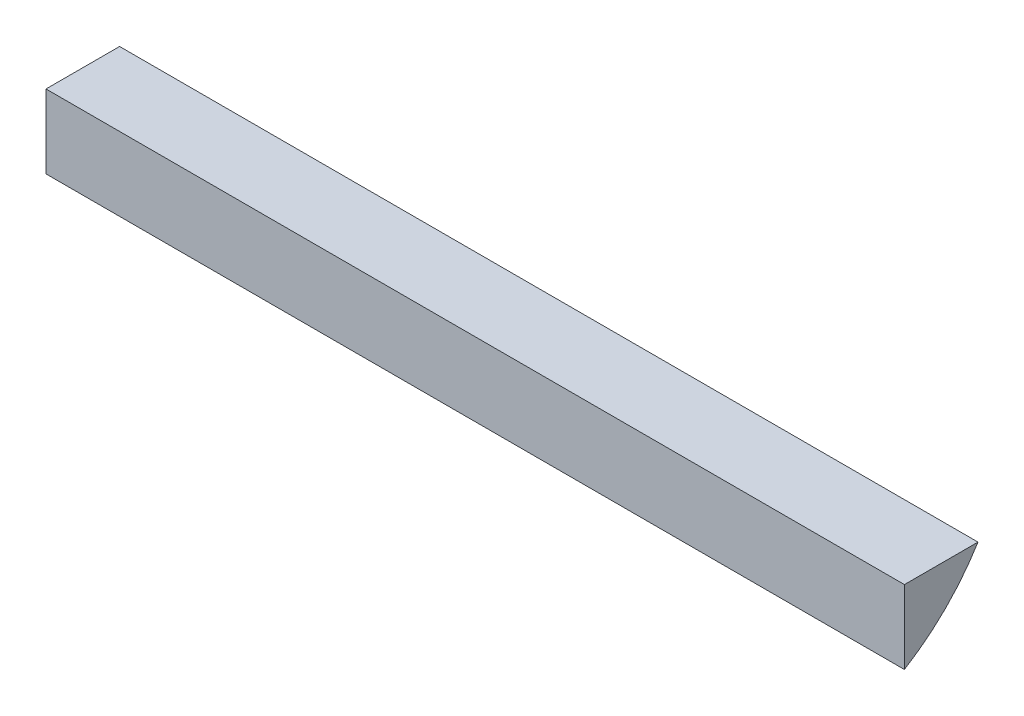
ISO-10303-21;
HEADER;
FILE_DESCRIPTION(('STEP AP214'),'2;1');
FILE_NAME('part.step','',(''),(''),'','','');
FILE_SCHEMA(('AUTOMOTIVE_DESIGN { 1 0 10303 214 1 1 1 1 }'));
ENDSEC;
DATA;
#1=APPLICATION_CONTEXT('core data for automotive mechanical design processes');
#2=APPLICATION_PROTOCOL_DEFINITION('international standard','automotive_design',2000,#1);
#3=PRODUCT_CONTEXT('',#1,'mechanical');
#4=PRODUCT('Part','Part','',(#3));
#5=PRODUCT_RELATED_PRODUCT_CATEGORY('part','',(#4));
#6=PRODUCT_DEFINITION_FORMATION('','',#4);
#7=PRODUCT_DEFINITION_CONTEXT('part definition',#1,'design');
#8=PRODUCT_DEFINITION('design','',#6,#7);
#9=PRODUCT_DEFINITION_SHAPE('','',#8);
#10=(LENGTH_UNIT() NAMED_UNIT(*) SI_UNIT(.MILLI.,.METRE.));
#11=(NAMED_UNIT(*) PLANE_ANGLE_UNIT() SI_UNIT($,.RADIAN.));
#12=(NAMED_UNIT(*) SI_UNIT($,.STERADIAN.) SOLID_ANGLE_UNIT());
#13=UNCERTAINTY_MEASURE_WITH_UNIT(LENGTH_MEASURE(1.E-05),#10,'distance_accuracy_value','');
#14=(GEOMETRIC_REPRESENTATION_CONTEXT(3) GLOBAL_UNCERTAINTY_ASSIGNED_CONTEXT((#13)) GLOBAL_UNIT_ASSIGNED_CONTEXT((#10,
#11,#12)) REPRESENTATION_CONTEXT('',''));
#15=CARTESIAN_POINT('',(0.,0.,0.));
#16=DIRECTION('',(0.,0.,1.));
#17=DIRECTION('',(1.,0.,0.));
#18=AXIS2_PLACEMENT_3D('',#15,#16,#17);
#19=CARTESIAN_POINT('',(145.,0.,-45.));
#20=DIRECTION('',(0.,1.,0.));
#21=DIRECTION('',(0.,0.,1.));
#22=AXIS2_PLACEMENT_3D('',#19,#20,#21);
#23=PLANE('',#22);
#24=DIRECTION('',(0.,0.,1.));
#25=VECTOR('',#24,1.);
#26=CARTESIAN_POINT('',(-2.64548536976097,0.,-111.));
#27=LINE('',#26,#25);
#28=CARTESIAN_POINT('',(-2.64548536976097,0.,-194.));
#29=VERTEX_POINT('',#28);
#30=CARTESIAN_POINT('',(-2.64548536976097,0.,-191.));
#31=VERTEX_POINT('',#30);
#32=EDGE_CURVE('E405',#29,#31,#27,.T.);
#33=ORIENTED_EDGE('',*,*,#32,.T.);
#34=DIRECTION('',(-1.,0.,0.));
#35=VECTOR('',#34,1.);
#36=CARTESIAN_POINT('',(-2.64548536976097,0.,-191.));
#37=LINE('',#36,#35);
#38=CARTESIAN_POINT('',(32.354514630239,0.,-191.));
#39=VERTEX_POINT('',#38);
#40=EDGE_CURVE('E385',#39,#31,#37,.T.);
#41=ORIENTED_EDGE('',*,*,#40,.F.);
#42=DIRECTION('',(0.,0.,-1.));
#43=VECTOR('',#42,1.);
#44=CARTESIAN_POINT('',(32.354514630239,0.,-111.));
#45=LINE('',#44,#43);
#46=CARTESIAN_POINT('',(32.354514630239,0.,-194.));
#47=VERTEX_POINT('',#46);
#48=EDGE_CURVE('E388',#39,#47,#45,.T.);
#49=ORIENTED_EDGE('',*,*,#48,.T.);
#50=DIRECTION('',(-1.,0.,0.));
#51=VECTOR('',#50,1.);
#52=CARTESIAN_POINT('',(32.354514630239,0.,-194.));
#53=LINE('',#52,#51);
#54=EDGE_CURVE('E359',#29,#47,#53,.F.);
#55=ORIENTED_EDGE('',*,*,#54,.F.);
#56=EDGE_LOOP('',(#33,#41,#49,#55));
#57=FACE_BOUND('',#56,.T.);
#58=ADVANCED_FACE('F355',(#57),#23,.T.);
#59=CARTESIAN_POINT('',(-2.64548536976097,4.77557268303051,-186.224427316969));
#60=DIRECTION('',(-1.,0.,0.));
#61=DIRECTION('',(0.,0.,1.));
#62=AXIS2_PLACEMENT_3D('',#59,#60,#61);
#63=PLANE('',#62);
#64=DIRECTION('',(0.,-1.,0.));
#65=VECTOR('',#64,1.);
#66=CARTESIAN_POINT('',(-2.64548536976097,-35.,-191.));
#67=LINE('',#66,#65);
#68=CARTESIAN_POINT('',(-2.64548536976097,-2.99999999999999,-191.));
#69=VERTEX_POINT('',#68);
#70=EDGE_CURVE('E404',#31,#69,#67,.T.);
#71=ORIENTED_EDGE('',*,*,#70,.F.);
#72=ORIENTED_EDGE('',*,*,#32,.F.);
#73=CARTESIAN_POINT('',(-2.64548536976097,4.77557268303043,-186.22442731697));
#74=DIRECTION('',(-1.,0.,0.));
#75=DIRECTION('',(0.,0.,1.));
#76=AXIS2_PLACEMENT_3D('',#73,#74,#75);
#77=CIRCLE('',#76,9.12499999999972);
#78=EDGE_CURVE('E398',#69,#29,#77,.F.);
#79=ORIENTED_EDGE('',*,*,#78,.F.);
#80=EDGE_LOOP('',(#71,#72,#79));
#81=FACE_BOUND('',#80,.T.);
#82=ADVANCED_FACE('F421',(#81),#63,.T.);
#83=CARTESIAN_POINT('',(-2.64548536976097,0.,-191.));
#84=DIRECTION('',(0.,0.,-1.));
#85=DIRECTION('',(-1.,0.,0.));
#86=AXIS2_PLACEMENT_3D('',#83,#84,#85);
#87=PLANE('',#86);
#88=DIRECTION('',(-1.,0.,0.));
#89=VECTOR('',#88,1.);
#90=CARTESIAN_POINT('',(32.354514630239,-2.99999999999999,-191.));
#91=LINE('',#90,#89);
#92=CARTESIAN_POINT('',(32.354514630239,-2.99999999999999,-191.));
#93=VERTEX_POINT('',#92);
#94=EDGE_CURVE('E365',#93,#69,#91,.T.);
#95=ORIENTED_EDGE('',*,*,#94,.F.);
#96=DIRECTION('',(0.,1.,0.));
#97=VECTOR('',#96,1.);
#98=CARTESIAN_POINT('',(32.354514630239,-35.,-191.));
#99=LINE('',#98,#97);
#100=EDGE_CURVE('E392',#93,#39,#99,.T.);
#101=ORIENTED_EDGE('',*,*,#100,.T.);
#102=ORIENTED_EDGE('',*,*,#40,.T.);
#103=ORIENTED_EDGE('',*,*,#70,.T.);
#104=EDGE_LOOP('',(#95,#101,#102,#103));
#105=FACE_BOUND('',#104,.T.);
#106=ADVANCED_FACE('F418',(#105),#87,.F.);
#107=CARTESIAN_POINT('',(32.354514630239,4.77557268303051,-186.224427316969));
#108=DIRECTION('',(-1.,0.,0.));
#109=DIRECTION('',(0.,0.,1.));
#110=AXIS2_PLACEMENT_3D('',#107,#108,#109);
#111=PLANE('',#110);
#112=ORIENTED_EDGE('',*,*,#100,.F.);
#113=CARTESIAN_POINT('',(32.354514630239,4.77557268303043,-186.22442731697));
#114=DIRECTION('',(-1.,0.,0.));
#115=DIRECTION('',(0.,0.,1.));
#116=AXIS2_PLACEMENT_3D('',#113,#114,#115);
#117=CIRCLE('',#116,9.12499999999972);
#118=EDGE_CURVE('E11',#47,#93,#117,.T.);
#119=ORIENTED_EDGE('',*,*,#118,.F.);
#120=ORIENTED_EDGE('',*,*,#48,.F.);
#121=EDGE_LOOP('',(#112,#119,#120));
#122=FACE_BOUND('',#121,.T.);
#123=ADVANCED_FACE('F394',(#122),#111,.F.);
#124=CARTESIAN_POINT('',(32.354514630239,4.77557268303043,-186.22442731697));
#125=DIRECTION('',(-1.,0.,0.));
#126=DIRECTION('',(0.,0.,1.));
#127=AXIS2_PLACEMENT_3D('',#124,#125,#126);
#128=CYLINDRICAL_SURFACE('',#127,9.12499999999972);
#129=ORIENTED_EDGE('',*,*,#118,.T.);
#130=ORIENTED_EDGE('',*,*,#94,.T.);
#131=ORIENTED_EDGE('',*,*,#78,.T.);
#132=ORIENTED_EDGE('',*,*,#54,.T.);
#133=EDGE_LOOP('',(#129,#130,#131,#132));
#134=FACE_BOUND('',#133,.T.);
#135=ADVANCED_FACE('F357',(#134),#128,.T.);
#136=CLOSED_SHELL('',(#58,#82,#106,#123,#135));
#137=MANIFOLD_SOLID_BREP('B2',#136);
#138=ADVANCED_BREP_SHAPE_REPRESENTATION('',(#18,#137),#14);
#139=SHAPE_DEFINITION_REPRESENTATION(#9,#138);
ENDSEC;
END-ISO-10303-21;
